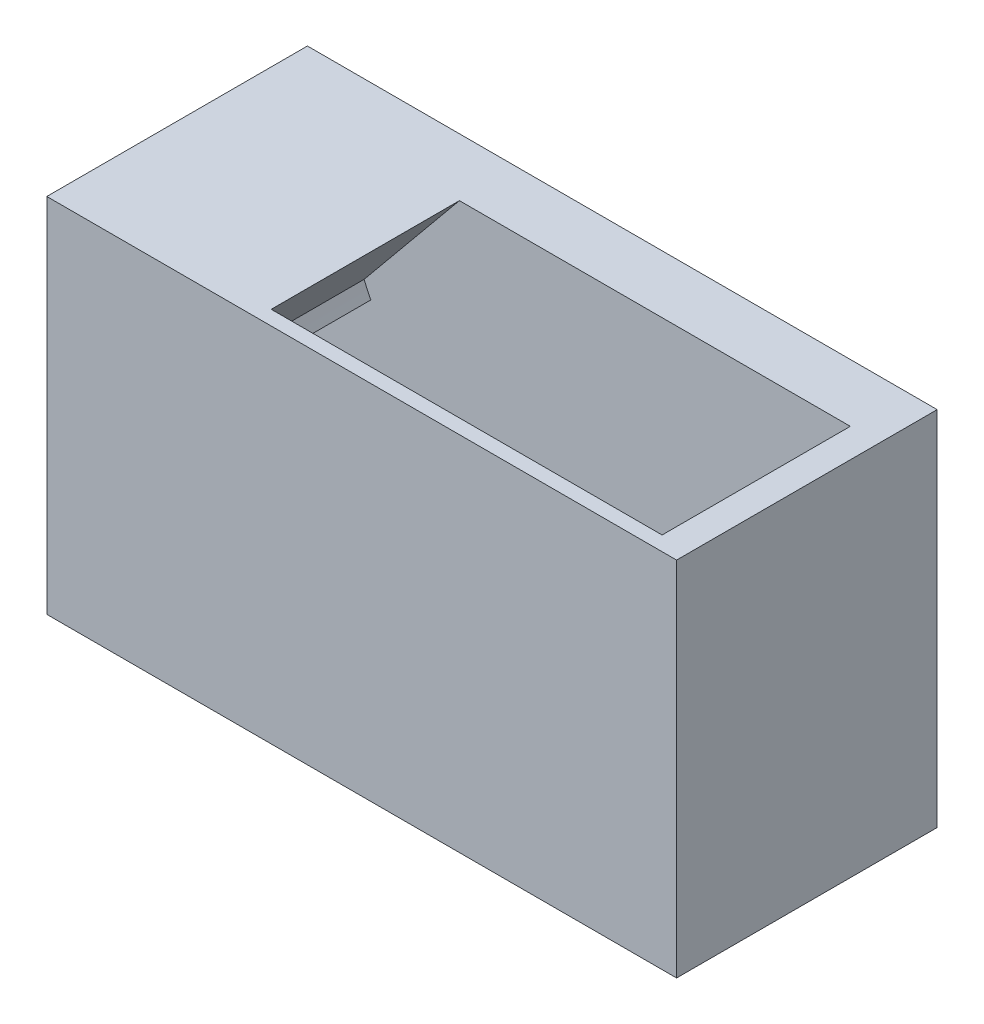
ISO-10303-21;
HEADER;
FILE_DESCRIPTION(('STEP AP214'),'2;1');
FILE_NAME('part.step','',(''),(''),'','','');
FILE_SCHEMA(('AUTOMOTIVE_DESIGN { 1 0 10303 214 1 1 1 1 }'));
ENDSEC;
DATA;
#1=APPLICATION_CONTEXT('core data for automotive mechanical design processes');
#2=APPLICATION_PROTOCOL_DEFINITION('international standard','automotive_design',2000,#1);
#3=PRODUCT_CONTEXT('',#1,'mechanical');
#4=PRODUCT('Part','Part','',(#3));
#5=PRODUCT_RELATED_PRODUCT_CATEGORY('part','',(#4));
#6=PRODUCT_DEFINITION_FORMATION('','',#4);
#7=PRODUCT_DEFINITION_CONTEXT('part definition',#1,'design');
#8=PRODUCT_DEFINITION('design','',#6,#7);
#9=PRODUCT_DEFINITION_SHAPE('','',#8);
#10=(LENGTH_UNIT() NAMED_UNIT(*) SI_UNIT(.MILLI.,.METRE.));
#11=(NAMED_UNIT(*) PLANE_ANGLE_UNIT() SI_UNIT($,.RADIAN.));
#12=(NAMED_UNIT(*) SI_UNIT($,.STERADIAN.) SOLID_ANGLE_UNIT());
#13=UNCERTAINTY_MEASURE_WITH_UNIT(LENGTH_MEASURE(1.E-05),#10,'distance_accuracy_value','');
#14=(GEOMETRIC_REPRESENTATION_CONTEXT(3) GLOBAL_UNCERTAINTY_ASSIGNED_CONTEXT((#13)) GLOBAL_UNIT_ASSIGNED_CONTEXT((#10,
#11,#12)) REPRESENTATION_CONTEXT('',''));
#15=CARTESIAN_POINT('',(0.,0.,0.));
#16=DIRECTION('',(0.,0.,1.));
#17=DIRECTION('',(1.,0.,0.));
#18=AXIS2_PLACEMENT_3D('',#15,#16,#17);
#19=CARTESIAN_POINT('',(-184.500000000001,34.9999999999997,75.9999999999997));
#20=DIRECTION('',(0.,0.,1.));
#21=DIRECTION('',(1.00000000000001,0.,0.));
#22=AXIS2_PLACEMENT_3D('',#19,#20,#21);
#23=PLANE('',#22);
#24=CARTESIAN_POINT('',(0.,103.,76.));
#25=DIRECTION('',(0.,0.,1.));
#26=DIRECTION('',(1.00000000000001,0.,0.));
#27=AXIS2_PLACEMENT_3D('',#24,#25,#26);
#28=CIRCLE('',#27,150.);
#29=CARTESIAN_POINT('',(-57.5000000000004,-35.5415100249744,75.9999999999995));
#30=VERTEX_POINT('',#29);
#31=CARTESIAN_POINT('',(-133.701159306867,35.,75.9999999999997));
#32=VERTEX_POINT('',#31);
#33=EDGE_CURVE('E207',#30,#32,#28,.F.);
#34=ORIENTED_EDGE('',*,*,#33,.F.);
#35=DIRECTION('',(0.,-1.00000000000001,0.));
#36=VECTOR('',#35,1.);
#37=CARTESIAN_POINT('',(-57.5000000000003,35.,76.));
#38=LINE('',#37,#36);
#39=CARTESIAN_POINT('',(-57.5000000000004,-125.,75.9999999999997));
#40=VERTEX_POINT('',#39);
#41=EDGE_CURVE('E261',#30,#40,#38,.T.);
#42=ORIENTED_EDGE('',*,*,#41,.T.);
#43=DIRECTION('',(-1.00000000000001,0.,0.));
#44=VECTOR('',#43,1.);
#45=CARTESIAN_POINT('',(-184.500000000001,-125.000000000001,76.));
#46=LINE('',#45,#44);
#47=CARTESIAN_POINT('',(-184.500000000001,-125.000000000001,76.));
#48=VERTEX_POINT('',#47);
#49=EDGE_CURVE('E246',#40,#48,#46,.T.);
#50=ORIENTED_EDGE('',*,*,#49,.T.);
#51=DIRECTION('',(0.,-1.00000000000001,0.));
#52=VECTOR('',#51,1.);
#53=CARTESIAN_POINT('',(-184.500000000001,34.9999999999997,75.9999999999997));
#54=LINE('',#53,#52);
#55=CARTESIAN_POINT('',(-184.500000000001,34.9999999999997,75.9999999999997));
#56=VERTEX_POINT('',#55);
#57=EDGE_CURVE('E258',#56,#48,#54,.T.);
#58=ORIENTED_EDGE('',*,*,#57,.F.);
#59=DIRECTION('',(-1.00000000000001,0.,0.));
#60=VECTOR('',#59,1.);
#61=CARTESIAN_POINT('',(-184.500000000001,34.9999999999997,75.9999999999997));
#62=LINE('',#61,#60);
#63=EDGE_CURVE('E255',#32,#56,#62,.T.);
#64=ORIENTED_EDGE('',*,*,#63,.F.);
#65=EDGE_LOOP('',(#34,#42,#50,#58,#64));
#66=FACE_BOUND('',#65,.T.);
#67=ADVANCED_FACE('F34',(#66),#23,.F.);
#68=CARTESIAN_POINT('',(-57.5000000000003,35.,76.));
#69=DIRECTION('',(1.00000000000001,0.,0.));
#70=DIRECTION('',(0.,0.,-1.));
#71=AXIS2_PLACEMENT_3D('',#68,#69,#70);
#72=PLANE('',#71);
#73=DIRECTION('',(0.,0.,-1.));
#74=VECTOR('',#73,1.);
#75=CARTESIAN_POINT('',(-57.5000000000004,-35.5415100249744,79.9999999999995));
#76=LINE('',#75,#74);
#77=CARTESIAN_POINT('',(-57.5000000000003,-35.5415100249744,-50.));
#78=VERTEX_POINT('',#77);
#79=EDGE_CURVE('E209',#78,#30,#76,.F.);
#80=ORIENTED_EDGE('',*,*,#79,.F.);
#81=DIRECTION('',(0.,-1.00000000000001,0.));
#82=VECTOR('',#81,1.);
#83=CARTESIAN_POINT('',(-57.5000000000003,34.9999999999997,-50.0000000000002));
#84=LINE('',#83,#82);
#85=CARTESIAN_POINT('',(-57.5000000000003,-125.,-50.0000000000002));
#86=VERTEX_POINT('',#85);
#87=EDGE_CURVE('E263',#78,#86,#84,.T.);
#88=ORIENTED_EDGE('',*,*,#87,.T.);
#89=DIRECTION('',(0.,0.,1.));
#90=VECTOR('',#89,1.);
#91=CARTESIAN_POINT('',(-57.5000000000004,-125.,75.9999999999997));
#92=LINE('',#91,#90);
#93=EDGE_CURVE('E243',#86,#40,#92,.T.);
#94=ORIENTED_EDGE('',*,*,#93,.T.);
#95=ORIENTED_EDGE('',*,*,#41,.F.);
#96=EDGE_LOOP('',(#80,#88,#94,#95));
#97=FACE_BOUND('',#96,.T.);
#98=ADVANCED_FACE('F326',(#97),#72,.F.);
#99=CARTESIAN_POINT('',(-184.500000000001,34.9999999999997,75.9999999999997));
#100=DIRECTION('',(0.,-1.00000000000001,0.));
#101=DIRECTION('',(0.,0.,-1.));
#102=AXIS2_PLACEMENT_3D('',#99,#100,#101);
#103=PLANE('',#102);
#104=DIRECTION('',(1.00000000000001,0.,0.));
#105=VECTOR('',#104,1.);
#106=CARTESIAN_POINT('',(-184.500000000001,34.9999999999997,-50.0000000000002));
#107=LINE('',#106,#105);
#108=CARTESIAN_POINT('',(-184.500000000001,34.9999999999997,-50.0000000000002));
#109=VERTEX_POINT('',#108);
#110=CARTESIAN_POINT('',(-133.701159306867,35.,-50.0000000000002));
#111=VERTEX_POINT('',#110);
#112=EDGE_CURVE('E252',#109,#111,#107,.T.);
#113=ORIENTED_EDGE('',*,*,#112,.T.);
#114=DIRECTION('',(0.,0.,-1.));
#115=VECTOR('',#114,1.);
#116=CARTESIAN_POINT('',(-133.701159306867,35.,79.9999999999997));
#117=LINE('',#116,#115);
#118=EDGE_CURVE('E204',#111,#32,#117,.F.);
#119=ORIENTED_EDGE('',*,*,#118,.T.);
#120=ORIENTED_EDGE('',*,*,#63,.T.);
#121=DIRECTION('',(0.,0.,-1.));
#122=VECTOR('',#121,1.);
#123=CARTESIAN_POINT('',(-184.500000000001,34.9999999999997,75.9999999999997));
#124=LINE('',#123,#122);
#125=EDGE_CURVE('E249',#56,#109,#124,.T.);
#126=ORIENTED_EDGE('',*,*,#125,.T.);
#127=EDGE_LOOP('',(#113,#119,#120,#126));
#128=FACE_BOUND('',#127,.T.);
#129=ADVANCED_FACE('F332',(#128),#103,.T.);
#130=CARTESIAN_POINT('',(67.5000000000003,35.,76.0000000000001));
#131=DIRECTION('',(-1.00000000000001,0.,0.));
#132=DIRECTION('',(0.,0.,1.));
#133=AXIS2_PLACEMENT_3D('',#130,#131,#132);
#134=PLANE('',#133);
#135=DIRECTION('',(0.,0.,-1.));
#136=VECTOR('',#135,1.);
#137=CARTESIAN_POINT('',(67.5000000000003,-30.9542832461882,80.0000000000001));
#138=LINE('',#137,#136);
#139=CARTESIAN_POINT('',(67.5000000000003,-30.9542832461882,76.0000000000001));
#140=VERTEX_POINT('',#139);
#141=CARTESIAN_POINT('',(67.5000000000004,-30.9542832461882,-50.0000000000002));
#142=VERTEX_POINT('',#141);
#143=EDGE_CURVE('E202',#140,#142,#138,.T.);
#144=ORIENTED_EDGE('',*,*,#143,.F.);
#145=DIRECTION('',(0.,-1.00000000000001,0.));
#146=VECTOR('',#145,1.);
#147=CARTESIAN_POINT('',(67.5000000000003,35.,76.0000000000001));
#148=LINE('',#147,#146);
#149=CARTESIAN_POINT('',(67.5000000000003,-125.000000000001,75.9999999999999));
#150=VERTEX_POINT('',#149);
#151=EDGE_CURVE('E231',#140,#150,#148,.T.);
#152=ORIENTED_EDGE('',*,*,#151,.T.);
#153=DIRECTION('',(0.,0.,-1.));
#154=VECTOR('',#153,1.);
#155=CARTESIAN_POINT('',(67.5000000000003,-125.000000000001,75.9999999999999));
#156=LINE('',#155,#154);
#157=CARTESIAN_POINT('',(67.5000000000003,-125.,-50.0000000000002));
#158=VERTEX_POINT('',#157);
#159=EDGE_CURVE('E211',#150,#158,#156,.T.);
#160=ORIENTED_EDGE('',*,*,#159,.T.);
#161=DIRECTION('',(0.,-1.00000000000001,0.));
#162=VECTOR('',#161,1.);
#163=CARTESIAN_POINT('',(67.5000000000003,35.,-50.0000000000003));
#164=LINE('',#163,#162);
#165=EDGE_CURVE('E230',#142,#158,#164,.T.);
#166=ORIENTED_EDGE('',*,*,#165,.F.);
#167=EDGE_LOOP('',(#144,#152,#160,#166));
#168=FACE_BOUND('',#167,.T.);
#169=ADVANCED_FACE('F359',(#168),#134,.F.);
#170=CARTESIAN_POINT('',(67.5000000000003,35.,76.0000000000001));
#171=DIRECTION('',(0.,0.,1.));
#172=DIRECTION('',(1.00000000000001,0.,0.));
#173=AXIS2_PLACEMENT_3D('',#170,#171,#172);
#174=PLANE('',#173);
#175=CARTESIAN_POINT('',(0.,103.,76.));
#176=DIRECTION('',(0.,0.,1.));
#177=DIRECTION('',(1.00000000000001,0.,0.));
#178=AXIS2_PLACEMENT_3D('',#175,#176,#177);
#179=CIRCLE('',#178,150.);
#180=CARTESIAN_POINT('',(133.701159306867,35.,76.));
#181=VERTEX_POINT('',#180);
#182=EDGE_CURVE('E175',#181,#140,#179,.F.);
#183=ORIENTED_EDGE('',*,*,#182,.F.);
#184=DIRECTION('',(-1.00000000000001,0.,0.));
#185=VECTOR('',#184,1.);
#186=CARTESIAN_POINT('',(67.5000000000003,35.,76.0000000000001));
#187=LINE('',#186,#185);
#188=CARTESIAN_POINT('',(197.500000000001,35.,76.));
#189=VERTEX_POINT('',#188);
#190=EDGE_CURVE('E227',#189,#181,#187,.T.);
#191=ORIENTED_EDGE('',*,*,#190,.F.);
#192=DIRECTION('',(0.,-1.00000000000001,0.));
#193=VECTOR('',#192,1.);
#194=CARTESIAN_POINT('',(197.500000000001,35.,76.));
#195=LINE('',#194,#193);
#196=CARTESIAN_POINT('',(197.500000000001,-125.,76.));
#197=VERTEX_POINT('',#196);
#198=EDGE_CURVE('E234',#189,#197,#195,.T.);
#199=ORIENTED_EDGE('',*,*,#198,.T.);
#200=DIRECTION('',(-1.00000000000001,0.,0.));
#201=VECTOR('',#200,1.);
#202=CARTESIAN_POINT('',(67.5000000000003,-125.000000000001,75.9999999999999));
#203=LINE('',#202,#201);
#204=EDGE_CURVE('E220',#197,#150,#203,.T.);
#205=ORIENTED_EDGE('',*,*,#204,.T.);
#206=ORIENTED_EDGE('',*,*,#151,.F.);
#207=EDGE_LOOP('',(#183,#191,#199,#205,#206));
#208=FACE_BOUND('',#207,.T.);
#209=ADVANCED_FACE('F372',(#208),#174,.F.);
#210=CARTESIAN_POINT('',(67.5000000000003,35.,-50.0000000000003));
#211=DIRECTION('',(0.,-1.00000000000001,0.));
#212=DIRECTION('',(0.,0.,-1.));
#213=AXIS2_PLACEMENT_3D('',#210,#211,#212);
#214=PLANE('',#213);
#215=ORIENTED_EDGE('',*,*,#190,.T.);
#216=DIRECTION('',(0.,0.,-1.));
#217=VECTOR('',#216,1.);
#218=CARTESIAN_POINT('',(133.701159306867,35.,80.));
#219=LINE('',#218,#217);
#220=CARTESIAN_POINT('',(133.701159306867,35.,-50.0000000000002));
#221=VERTEX_POINT('',#220);
#222=EDGE_CURVE('E11',#181,#221,#219,.T.);
#223=ORIENTED_EDGE('',*,*,#222,.T.);
#224=DIRECTION('',(1.00000000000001,0.,0.));
#225=VECTOR('',#224,1.);
#226=CARTESIAN_POINT('',(67.5000000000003,35.,-50.0000000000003));
#227=LINE('',#226,#225);
#228=CARTESIAN_POINT('',(197.500000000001,35.,-50.0000000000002));
#229=VERTEX_POINT('',#228);
#230=EDGE_CURVE('E163',#221,#229,#227,.T.);
#231=ORIENTED_EDGE('',*,*,#230,.T.);
#232=DIRECTION('',(0.,0.,1.));
#233=VECTOR('',#232,1.);
#234=CARTESIAN_POINT('',(197.500000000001,35.,76.));
#235=LINE('',#234,#233);
#236=EDGE_CURVE('E224',#229,#189,#235,.T.);
#237=ORIENTED_EDGE('',*,*,#236,.T.);
#238=EDGE_LOOP('',(#215,#223,#231,#237));
#239=FACE_BOUND('',#238,.T.);
#240=ADVANCED_FACE('F369',(#239),#214,.T.);
#241=CARTESIAN_POINT('',(-217.500000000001,125.000000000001,-90.0000000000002));
#242=DIRECTION('',(1.00000000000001,0.,0.));
#243=DIRECTION('',(0.,0.,-1.));
#244=AXIS2_PLACEMENT_3D('',#241,#242,#243);
#245=PLANE('',#244);
#246=DIRECTION('',(0.,0.,1.));
#247=VECTOR('',#246,1.);
#248=CARTESIAN_POINT('',(-217.500000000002,-125.000000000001,-90.0000000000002));
#249=LINE('',#248,#247);
#250=CARTESIAN_POINT('',(-217.500000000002,-125.000000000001,-90.0000000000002));
#251=VERTEX_POINT('',#250);
#252=CARTESIAN_POINT('',(-217.500000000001,-125.000000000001,89.9999999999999));
#253=VERTEX_POINT('',#252);
#254=EDGE_CURVE('E260',#251,#253,#249,.T.);
#255=ORIENTED_EDGE('',*,*,#254,.T.);
#256=DIRECTION('',(0.,-1.00000000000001,0.));
#257=VECTOR('',#256,1.);
#258=CARTESIAN_POINT('',(-217.500000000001,125.000000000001,89.9999999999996));
#259=LINE('',#258,#257);
#260=CARTESIAN_POINT('',(-217.500000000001,125.000000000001,89.9999999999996));
#261=VERTEX_POINT('',#260);
#262=EDGE_CURVE('E42',#261,#253,#259,.T.);
#263=ORIENTED_EDGE('',*,*,#262,.F.);
#264=DIRECTION('',(0.,0.,1.));
#265=VECTOR('',#264,1.);
#266=CARTESIAN_POINT('',(-217.500000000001,125.000000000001,-90.0000000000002));
#267=LINE('',#266,#265);
#268=CARTESIAN_POINT('',(-217.500000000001,125.000000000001,-90.0000000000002));
#269=VERTEX_POINT('',#268);
#270=EDGE_CURVE('E275',#269,#261,#267,.T.);
#271=ORIENTED_EDGE('',*,*,#270,.F.);
#272=DIRECTION('',(0.,-1.00000000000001,0.));
#273=VECTOR('',#272,1.);
#274=CARTESIAN_POINT('',(-217.500000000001,125.000000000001,-90.0000000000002));
#275=LINE('',#274,#273);
#276=EDGE_CURVE('E284',#269,#251,#275,.T.);
#277=ORIENTED_EDGE('',*,*,#276,.T.);
#278=EDGE_LOOP('',(#255,#263,#271,#277));
#279=FACE_BOUND('',#278,.T.);
#280=ADVANCED_FACE('F36',(#279),#245,.F.);
#281=CARTESIAN_POINT('',(-217.500000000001,125.000000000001,89.9999999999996));
#282=DIRECTION('',(0.,0.,-1.));
#283=DIRECTION('',(-1.00000000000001,0.,0.));
#284=AXIS2_PLACEMENT_3D('',#281,#282,#283);
#285=PLANE('',#284);
#286=DIRECTION('',(1.00000000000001,0.,0.));
#287=VECTOR('',#286,1.);
#288=CARTESIAN_POINT('',(-217.500000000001,-125.000000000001,89.9999999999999));
#289=LINE('',#288,#287);
#290=CARTESIAN_POINT('',(217.500000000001,-125.000000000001,90.));
#291=VERTEX_POINT('',#290);
#292=EDGE_CURVE('E269',#253,#291,#289,.T.);
#293=ORIENTED_EDGE('',*,*,#292,.T.);
#294=DIRECTION('',(0.,-1.00000000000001,0.));
#295=VECTOR('',#294,1.);
#296=CARTESIAN_POINT('',(217.500000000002,125.000000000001,90.));
#297=LINE('',#296,#295);
#298=CARTESIAN_POINT('',(217.500000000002,125.000000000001,90.));
#299=VERTEX_POINT('',#298);
#300=EDGE_CURVE('E290',#299,#291,#297,.T.);
#301=ORIENTED_EDGE('',*,*,#300,.F.);
#302=DIRECTION('',(1.00000000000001,0.,0.));
#303=VECTOR('',#302,1.);
#304=CARTESIAN_POINT('',(-217.500000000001,125.000000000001,89.9999999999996));
#305=LINE('',#304,#303);
#306=EDGE_CURVE('E278',#261,#299,#305,.T.);
#307=ORIENTED_EDGE('',*,*,#306,.F.);
#308=ORIENTED_EDGE('',*,*,#262,.T.);
#309=EDGE_LOOP('',(#293,#301,#307,#308));
#310=FACE_BOUND('',#309,.T.);
#311=ADVANCED_FACE('F295',(#310),#285,.F.);
#312=CARTESIAN_POINT('',(217.500000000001,125.000000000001,-90.0000000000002));
#313=DIRECTION('',(-1.00000000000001,0.,0.));
#314=DIRECTION('',(0.,0.,1.));
#315=AXIS2_PLACEMENT_3D('',#312,#313,#314);
#316=PLANE('',#315);
#317=DIRECTION('',(0.,0.,-1.));
#318=VECTOR('',#317,1.);
#319=CARTESIAN_POINT('',(217.500000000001,-125.000000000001,-90.0000000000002));
#320=LINE('',#319,#318);
#321=CARTESIAN_POINT('',(217.500000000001,-125.000000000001,-90.0000000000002));
#322=VERTEX_POINT('',#321);
#323=EDGE_CURVE('E271',#291,#322,#320,.T.);
#324=ORIENTED_EDGE('',*,*,#323,.T.);
#325=DIRECTION('',(0.,-1.00000000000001,0.));
#326=VECTOR('',#325,1.);
#327=CARTESIAN_POINT('',(217.500000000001,125.000000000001,-90.0000000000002));
#328=LINE('',#327,#326);
#329=CARTESIAN_POINT('',(217.500000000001,125.000000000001,-90.0000000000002));
#330=VERTEX_POINT('',#329);
#331=EDGE_CURVE('E287',#330,#322,#328,.T.);
#332=ORIENTED_EDGE('',*,*,#331,.F.);
#333=DIRECTION('',(0.,0.,-1.));
#334=VECTOR('',#333,1.);
#335=CARTESIAN_POINT('',(217.500000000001,125.000000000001,-90.0000000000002));
#336=LINE('',#335,#334);
#337=EDGE_CURVE('E280',#299,#330,#336,.T.);
#338=ORIENTED_EDGE('',*,*,#337,.F.);
#339=ORIENTED_EDGE('',*,*,#300,.T.);
#340=EDGE_LOOP('',(#324,#332,#338,#339));
#341=FACE_BOUND('',#340,.T.);
#342=ADVANCED_FACE('F307',(#341),#316,.F.);
#343=CARTESIAN_POINT('',(-217.500000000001,125.000000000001,-90.0000000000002));
#344=DIRECTION('',(0.,0.,1.));
#345=DIRECTION('',(1.00000000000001,0.,0.));
#346=AXIS2_PLACEMENT_3D('',#343,#344,#345);
#347=PLANE('',#346);
#348=DIRECTION('',(-1.00000000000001,0.,0.));
#349=VECTOR('',#348,1.);
#350=CARTESIAN_POINT('',(-217.500000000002,-125.000000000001,-90.0000000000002));
#351=LINE('',#350,#349);
#352=EDGE_CURVE('E273',#322,#251,#351,.T.);
#353=ORIENTED_EDGE('',*,*,#352,.T.);
#354=ORIENTED_EDGE('',*,*,#276,.F.);
#355=DIRECTION('',(-1.00000000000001,0.,0.));
#356=VECTOR('',#355,1.);
#357=CARTESIAN_POINT('',(-217.500000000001,125.000000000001,-90.0000000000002));
#358=LINE('',#357,#356);
#359=EDGE_CURVE('E282',#330,#269,#358,.T.);
#360=ORIENTED_EDGE('',*,*,#359,.F.);
#361=ORIENTED_EDGE('',*,*,#331,.T.);
#362=EDGE_LOOP('',(#353,#354,#360,#361));
#363=FACE_BOUND('',#362,.T.);
#364=ADVANCED_FACE('F311',(#363),#347,.F.);
#365=CARTESIAN_POINT('',(-217.500000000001,125.000000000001,89.9999999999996));
#366=DIRECTION('',(0.,1.00000000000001,0.));
#367=DIRECTION('',(0.,0.,1.));
#368=AXIS2_PLACEMENT_3D('',#365,#366,#367);
#369=PLANE('',#368);
#370=DIRECTION('',(-1.00000000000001,0.,0.));
#371=VECTOR('',#370,1.);
#372=CARTESIAN_POINT('',(-72.5000000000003,125.000000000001,79.9999999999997));
#373=LINE('',#372,#371);
#374=CARTESIAN_POINT('',(197.500000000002,125.000000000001,80.));
#375=VERTEX_POINT('',#374);
#376=CARTESIAN_POINT('',(-72.5000000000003,125.000000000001,79.9999999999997));
#377=VERTEX_POINT('',#376);
#378=EDGE_CURVE('E190',#375,#377,#373,.T.);
#379=ORIENTED_EDGE('',*,*,#378,.T.);
#380=DIRECTION('',(0.,0.,-1.));
#381=VECTOR('',#380,1.);
#382=CARTESIAN_POINT('',(-72.5000000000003,125.000000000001,79.9999999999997));
#383=LINE('',#382,#381);
#384=CARTESIAN_POINT('',(-72.5000000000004,125.000000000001,-50.0000000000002));
#385=VERTEX_POINT('',#384);
#386=EDGE_CURVE('E197',#377,#385,#383,.T.);
#387=ORIENTED_EDGE('',*,*,#386,.T.);
#388=DIRECTION('',(-1.00000000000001,0.,0.));
#389=VECTOR('',#388,1.);
#390=CARTESIAN_POINT('',(-72.5000000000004,125.000000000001,-50.0000000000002));
#391=LINE('',#390,#389);
#392=CARTESIAN_POINT('',(197.500000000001,125.000000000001,-50.0000000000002));
#393=VERTEX_POINT('',#392);
#394=EDGE_CURVE('E181',#393,#385,#391,.T.);
#395=ORIENTED_EDGE('',*,*,#394,.F.);
#396=DIRECTION('',(0.,0.,-1.));
#397=VECTOR('',#396,1.);
#398=CARTESIAN_POINT('',(197.500000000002,125.000000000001,80.));
#399=LINE('',#398,#397);
#400=EDGE_CURVE('E176',#375,#393,#399,.T.);
#401=ORIENTED_EDGE('',*,*,#400,.F.);
#402=EDGE_LOOP('',(#379,#387,#395,#401));
#403=FACE_BOUND('',#402,.T.);
#404=ORIENTED_EDGE('',*,*,#270,.T.);
#405=ORIENTED_EDGE('',*,*,#306,.T.);
#406=ORIENTED_EDGE('',*,*,#337,.T.);
#407=ORIENTED_EDGE('',*,*,#359,.T.);
#408=EDGE_LOOP('',(#404,#405,#406,#407));
#409=FACE_BOUND('',#408,.T.);
#410=ADVANCED_FACE('F313',(#403,#409),#369,.T.);
#411=CARTESIAN_POINT('',(-217.500000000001,-125.000000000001,89.9999999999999));
#412=DIRECTION('',(0.,1.00000000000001,0.));
#413=DIRECTION('',(0.,0.,1.));
#414=AXIS2_PLACEMENT_3D('',#411,#412,#413);
#415=PLANE('',#414);
#416=DIRECTION('',(1.00000000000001,0.,0.));
#417=VECTOR('',#416,1.);
#418=CARTESIAN_POINT('',(67.5000000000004,-125.,-50.0000000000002));
#419=LINE('',#418,#417);
#420=CARTESIAN_POINT('',(197.500000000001,-125.,-50.0000000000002));
#421=VERTEX_POINT('',#420);
#422=EDGE_CURVE('E214',#158,#421,#419,.T.);
#423=ORIENTED_EDGE('',*,*,#422,.F.);
#424=ORIENTED_EDGE('',*,*,#159,.F.);
#425=ORIENTED_EDGE('',*,*,#204,.F.);
#426=DIRECTION('',(0.,0.,1.));
#427=VECTOR('',#426,1.);
#428=CARTESIAN_POINT('',(197.500000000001,-125.,76.));
#429=LINE('',#428,#427);
#430=EDGE_CURVE('E217',#421,#197,#429,.T.);
#431=ORIENTED_EDGE('',*,*,#430,.F.);
#432=EDGE_LOOP('',(#423,#424,#425,#431));
#433=FACE_BOUND('',#432,.T.);
#434=DIRECTION('',(1.00000000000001,0.,0.));
#435=VECTOR('',#434,1.);
#436=CARTESIAN_POINT('',(-184.500000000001,-125.000000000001,-50.0000000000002));
#437=LINE('',#436,#435);
#438=CARTESIAN_POINT('',(-184.500000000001,-125.000000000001,-50.0000000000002));
#439=VERTEX_POINT('',#438);
#440=EDGE_CURVE('E240',#439,#86,#437,.T.);
#441=ORIENTED_EDGE('',*,*,#440,.F.);
#442=DIRECTION('',(0.,0.,-1.));
#443=VECTOR('',#442,1.);
#444=CARTESIAN_POINT('',(-184.500000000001,-125.000000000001,76.));
#445=LINE('',#444,#443);
#446=EDGE_CURVE('E233',#48,#439,#445,.T.);
#447=ORIENTED_EDGE('',*,*,#446,.F.);
#448=ORIENTED_EDGE('',*,*,#49,.F.);
#449=ORIENTED_EDGE('',*,*,#93,.F.);
#450=EDGE_LOOP('',(#441,#447,#448,#449));
#451=FACE_BOUND('',#450,.T.);
#452=ORIENTED_EDGE('',*,*,#254,.F.);
#453=ORIENTED_EDGE('',*,*,#352,.F.);
#454=ORIENTED_EDGE('',*,*,#323,.F.);
#455=ORIENTED_EDGE('',*,*,#292,.F.);
#456=EDGE_LOOP('',(#452,#453,#454,#455));
#457=FACE_BOUND('',#456,.T.);
#458=ADVANCED_FACE('F303',(#433,#451,#457),#415,.F.);
#459=CARTESIAN_POINT('',(-184.500000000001,34.9999999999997,75.9999999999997));
#460=DIRECTION('',(-1.00000000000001,0.,0.));
#461=DIRECTION('',(0.,0.,1.));
#462=AXIS2_PLACEMENT_3D('',#459,#460,#461);
#463=PLANE('',#462);
#464=ORIENTED_EDGE('',*,*,#446,.T.);
#465=DIRECTION('',(0.,-1.00000000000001,0.));
#466=VECTOR('',#465,1.);
#467=CARTESIAN_POINT('',(-184.500000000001,34.9999999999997,-50.0000000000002));
#468=LINE('',#467,#466);
#469=EDGE_CURVE('E257',#109,#439,#468,.T.);
#470=ORIENTED_EDGE('',*,*,#469,.F.);
#471=ORIENTED_EDGE('',*,*,#125,.F.);
#472=ORIENTED_EDGE('',*,*,#57,.T.);
#473=EDGE_LOOP('',(#464,#470,#471,#472));
#474=FACE_BOUND('',#473,.T.);
#475=ADVANCED_FACE('F321',(#474),#463,.F.);
#476=CARTESIAN_POINT('',(-184.500000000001,34.9999999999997,-50.0000000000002));
#477=DIRECTION('',(0.,0.,-1.));
#478=DIRECTION('',(-1.00000000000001,0.,0.));
#479=AXIS2_PLACEMENT_3D('',#476,#477,#478);
#480=PLANE('',#479);
#481=ORIENTED_EDGE('',*,*,#87,.F.);
#482=CARTESIAN_POINT('',(0.,103.,-50.));
#483=DIRECTION('',(0.,0.,1.));
#484=DIRECTION('',(1.00000000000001,0.,0.));
#485=AXIS2_PLACEMENT_3D('',#482,#483,#484);
#486=CIRCLE('',#485,150.);
#487=EDGE_CURVE('E165',#78,#142,#486,.T.);
#488=ORIENTED_EDGE('',*,*,#487,.T.);
#489=ORIENTED_EDGE('',*,*,#165,.T.);
#490=ORIENTED_EDGE('',*,*,#422,.T.);
#491=DIRECTION('',(0.,-1.00000000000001,0.));
#492=VECTOR('',#491,1.);
#493=CARTESIAN_POINT('',(197.500000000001,35.,-50.0000000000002));
#494=LINE('',#493,#492);
#495=EDGE_CURVE('E236',#229,#421,#494,.T.);
#496=ORIENTED_EDGE('',*,*,#495,.F.);
#497=ORIENTED_EDGE('',*,*,#230,.F.);
#498=CARTESIAN_POINT('',(138.332931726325,45.0000000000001,-50.0000000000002));
#499=VERTEX_POINT('',#498);
#500=EDGE_CURVE('E158',#221,#499,#486,.T.);
#501=ORIENTED_EDGE('',*,*,#500,.T.);
#502=DIRECTION('',(0.594629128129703,0.804000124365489,0.));
#503=VECTOR('',#502,1.);
#504=CARTESIAN_POINT('',(197.500000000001,125.000000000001,-50.0000000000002));
#505=LINE('',#504,#503);
#506=EDGE_CURVE('E49',#499,#393,#505,.T.);
#507=ORIENTED_EDGE('',*,*,#506,.T.);
#508=ORIENTED_EDGE('',*,*,#394,.T.);
#509=DIRECTION('',(-0.635422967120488,-0.77216426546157,0.));
#510=VECTOR('',#509,1.);
#511=CARTESIAN_POINT('',(-72.5000000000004,125.000000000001,-50.0000000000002));
#512=LINE('',#511,#510);
#513=CARTESIAN_POINT('',(-138.332931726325,45.,-50.0000000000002));
#514=VERTEX_POINT('',#513);
#515=EDGE_CURVE('E183',#385,#514,#512,.T.);
#516=ORIENTED_EDGE('',*,*,#515,.T.);
#517=EDGE_CURVE('E56',#514,#111,#486,.T.);
#518=ORIENTED_EDGE('',*,*,#517,.T.);
#519=ORIENTED_EDGE('',*,*,#112,.F.);
#520=ORIENTED_EDGE('',*,*,#469,.T.);
#521=ORIENTED_EDGE('',*,*,#440,.T.);
#522=EDGE_LOOP('',(#481,#488,#489,#490,#496,#497,#501,#507,#508,#516,#518,#519,#520,#521));
#523=FACE_BOUND('',#522,.T.);
#524=ADVANCED_FACE('F161',(#523),#480,.F.);
#525=CARTESIAN_POINT('',(197.500000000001,35.,76.));
#526=DIRECTION('',(1.00000000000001,0.,0.));
#527=DIRECTION('',(0.,0.,-1.));
#528=AXIS2_PLACEMENT_3D('',#525,#526,#527);
#529=PLANE('',#528);
#530=ORIENTED_EDGE('',*,*,#430,.T.);
#531=ORIENTED_EDGE('',*,*,#198,.F.);
#532=ORIENTED_EDGE('',*,*,#236,.F.);
#533=ORIENTED_EDGE('',*,*,#495,.T.);
#534=EDGE_LOOP('',(#530,#531,#532,#533));
#535=FACE_BOUND('',#534,.T.);
#536=ADVANCED_FACE('F341',(#535),#529,.F.);
#537=CARTESIAN_POINT('',(0.,103.,80.));
#538=DIRECTION('',(0.,0.,-1.));
#539=DIRECTION('',(-1.00000000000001,0.,0.));
#540=AXIS2_PLACEMENT_3D('',#537,#538,#539);
#541=CYLINDRICAL_SURFACE('',#540,150.);
#542=ORIENTED_EDGE('',*,*,#79,.T.);
#543=ORIENTED_EDGE('',*,*,#33,.T.);
#544=ORIENTED_EDGE('',*,*,#118,.F.);
#545=ORIENTED_EDGE('',*,*,#517,.F.);
#546=DIRECTION('',(0.,0.,-1.));
#547=VECTOR('',#546,1.);
#548=CARTESIAN_POINT('',(-138.332931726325,45.,79.9999999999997));
#549=LINE('',#548,#547);
#550=CARTESIAN_POINT('',(-138.332931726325,45.,79.9999999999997));
#551=VERTEX_POINT('',#550);
#552=EDGE_CURVE('E195',#551,#514,#549,.T.);
#553=ORIENTED_EDGE('',*,*,#552,.F.);
#554=CARTESIAN_POINT('',(0.,103.,80.));
#555=DIRECTION('',(0.,0.,1.));
#556=DIRECTION('',(1.00000000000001,0.,0.));
#557=AXIS2_PLACEMENT_3D('',#554,#555,#556);
#558=CIRCLE('',#557,150.);
#559=CARTESIAN_POINT('',(138.332931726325,45.0000000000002,80.));
#560=VERTEX_POINT('',#559);
#561=EDGE_CURVE('E173',#551,#560,#558,.T.);
#562=ORIENTED_EDGE('',*,*,#561,.T.);
#563=DIRECTION('',(0.,0.,-1.));
#564=VECTOR('',#563,1.);
#565=CARTESIAN_POINT('',(138.332931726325,45.0000000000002,80.));
#566=LINE('',#565,#564);
#567=EDGE_CURVE('E169',#560,#499,#566,.T.);
#568=ORIENTED_EDGE('',*,*,#567,.T.);
#569=ORIENTED_EDGE('',*,*,#500,.F.);
#570=ORIENTED_EDGE('',*,*,#222,.F.);
#571=ORIENTED_EDGE('',*,*,#182,.T.);
#572=ORIENTED_EDGE('',*,*,#143,.T.);
#573=ORIENTED_EDGE('',*,*,#487,.F.);
#574=EDGE_LOOP('',(#542,#543,#544,#545,#553,#562,#568,#569,#570,#571,#572,#573));
#575=FACE_BOUND('',#574,.T.);
#576=ADVANCED_FACE('F170',(#575),#541,.F.);
#577=CARTESIAN_POINT('',(197.500000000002,125.000000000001,80.));
#578=DIRECTION('',(-0.804000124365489,0.594629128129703,0.));
#579=DIRECTION('',(-0.594629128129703,-0.804000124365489,0.));
#580=AXIS2_PLACEMENT_3D('',#577,#578,#579);
#581=PLANE('',#580);
#582=ORIENTED_EDGE('',*,*,#567,.F.);
#583=DIRECTION('',(0.594629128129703,0.804000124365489,0.));
#584=VECTOR('',#583,1.);
#585=CARTESIAN_POINT('',(197.500000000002,125.000000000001,80.));
#586=LINE('',#585,#584);
#587=EDGE_CURVE('E188',#560,#375,#586,.T.);
#588=ORIENTED_EDGE('',*,*,#587,.T.);
#589=ORIENTED_EDGE('',*,*,#400,.T.);
#590=ORIENTED_EDGE('',*,*,#506,.F.);
#591=EDGE_LOOP('',(#582,#588,#589,#590));
#592=FACE_BOUND('',#591,.T.);
#593=ADVANCED_FACE('F178',(#592),#581,.T.);
#594=CARTESIAN_POINT('',(-72.5000000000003,125.000000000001,79.9999999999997));
#595=DIRECTION('',(0.77216426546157,-0.635422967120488,0.));
#596=DIRECTION('',(0.635422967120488,0.77216426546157,0.));
#597=AXIS2_PLACEMENT_3D('',#594,#595,#596);
#598=PLANE('',#597);
#599=ORIENTED_EDGE('',*,*,#386,.F.);
#600=DIRECTION('',(-0.635422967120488,-0.77216426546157,0.));
#601=VECTOR('',#600,1.);
#602=CARTESIAN_POINT('',(-72.5000000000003,125.000000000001,79.9999999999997));
#603=LINE('',#602,#601);
#604=EDGE_CURVE('E193',#377,#551,#603,.T.);
#605=ORIENTED_EDGE('',*,*,#604,.T.);
#606=ORIENTED_EDGE('',*,*,#552,.T.);
#607=ORIENTED_EDGE('',*,*,#515,.F.);
#608=EDGE_LOOP('',(#599,#605,#606,#607));
#609=FACE_BOUND('',#608,.T.);
#610=ADVANCED_FACE('F389',(#609),#598,.T.);
#611=CARTESIAN_POINT('',(0.,103.,80.));
#612=DIRECTION('',(0.,0.,1.));
#613=DIRECTION('',(1.00000000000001,0.,0.));
#614=AXIS2_PLACEMENT_3D('',#611,#612,#613);
#615=PLANE('',#614);
#616=ORIENTED_EDGE('',*,*,#561,.F.);
#617=ORIENTED_EDGE('',*,*,#604,.F.);
#618=ORIENTED_EDGE('',*,*,#378,.F.);
#619=ORIENTED_EDGE('',*,*,#587,.F.);
#620=EDGE_LOOP('',(#616,#617,#618,#619));
#621=FACE_BOUND('',#620,.T.);
#622=ADVANCED_FACE('F394',(#621),#615,.F.);
#623=CLOSED_SHELL('',(#67,#98,#129,#169,#209,#240,#280,#311,#342,#364,#410,#458,#475,#524,#536,
#576,#593,#610,#622));
#624=MANIFOLD_SOLID_BREP('B2',#623);
#625=ADVANCED_BREP_SHAPE_REPRESENTATION('',(#18,#624),#14);
#626=SHAPE_DEFINITION_REPRESENTATION(#9,#625);
ENDSEC;
END-ISO-10303-21;
